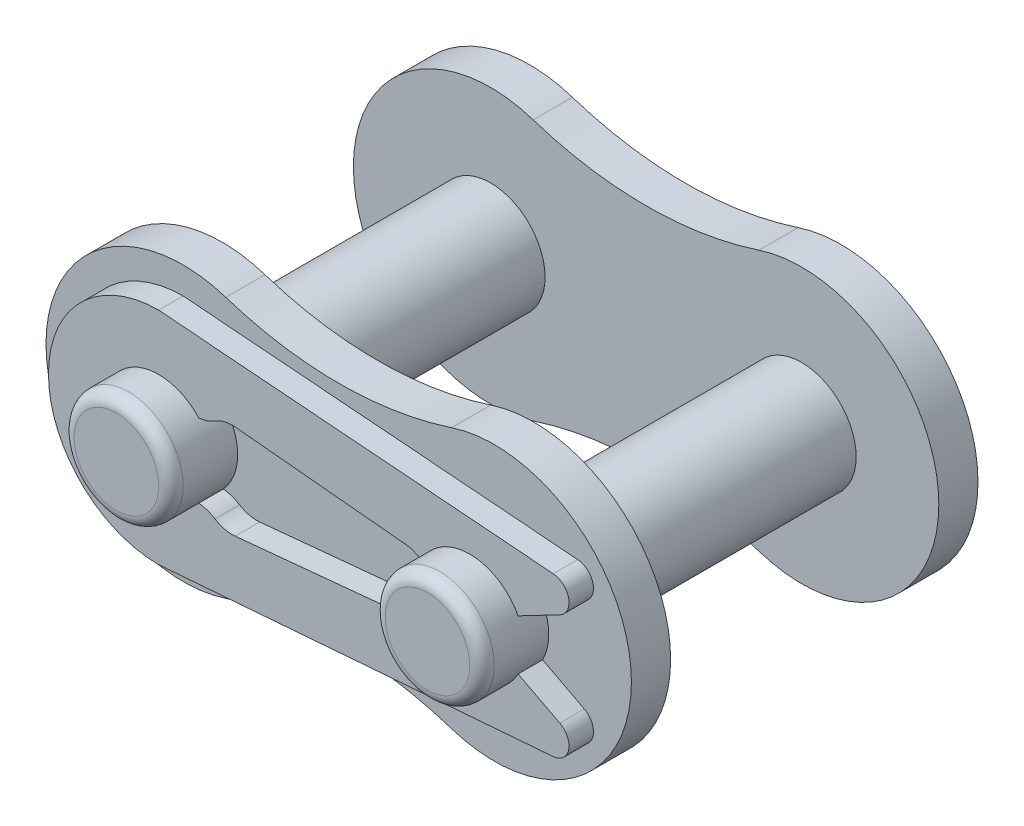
ISO-10303-21;
HEADER;
FILE_DESCRIPTION(('STEP AP214'),'2;1');
FILE_NAME('part.step','',(''),(''),'','','');
FILE_SCHEMA(('AUTOMOTIVE_DESIGN { 1 0 10303 214 1 1 1 1 }'));
ENDSEC;
DATA;
#1=APPLICATION_CONTEXT('core data for automotive mechanical design processes');
#2=APPLICATION_PROTOCOL_DEFINITION('international standard','automotive_design',2000,#1);
#3=PRODUCT_CONTEXT('',#1,'mechanical');
#4=PRODUCT('Part','Part','',(#3));
#5=PRODUCT_RELATED_PRODUCT_CATEGORY('part','',(#4));
#6=PRODUCT_DEFINITION_FORMATION('','',#4);
#7=PRODUCT_DEFINITION_CONTEXT('part definition',#1,'design');
#8=PRODUCT_DEFINITION('design','',#6,#7);
#9=PRODUCT_DEFINITION_SHAPE('','',#8);
#10=(LENGTH_UNIT() NAMED_UNIT(*) SI_UNIT(.MILLI.,.METRE.));
#11=(NAMED_UNIT(*) PLANE_ANGLE_UNIT() SI_UNIT($,.RADIAN.));
#12=(NAMED_UNIT(*) SI_UNIT($,.STERADIAN.) SOLID_ANGLE_UNIT());
#13=UNCERTAINTY_MEASURE_WITH_UNIT(LENGTH_MEASURE(1.E-05),#10,'distance_accuracy_value','');
#14=(GEOMETRIC_REPRESENTATION_CONTEXT(3) GLOBAL_UNCERTAINTY_ASSIGNED_CONTEXT((#13)) GLOBAL_UNIT_ASSIGNED_CONTEXT((#10,
#11,#12)) REPRESENTATION_CONTEXT('',''));
#15=CARTESIAN_POINT('',(0.,0.,0.));
#16=DIRECTION('',(0.,0.,1.));
#17=DIRECTION('',(1.,0.,0.));
#18=AXIS2_PLACEMENT_3D('',#15,#16,#17);
#19=CARTESIAN_POINT('',(-3.175,9.70378663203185,7.075));
#20=DIRECTION('',(0.,0.,-1.));
#21=DIRECTION('',(1.,0.,0.));
#22=AXIS2_PLACEMENT_3D('',#19,#20,#21);
#23=PLANE('',#22);
#24=CARTESIAN_POINT('',(-11.2,3.,7.075));
#25=DIRECTION('',(0.,0.,1.));
#26=DIRECTION('',(1.,0.,0.));
#27=AXIS2_PLACEMENT_3D('',#24,#25,#26);
#28=CIRCLE('',#27,1.5);
#29=CARTESIAN_POINT('',(-11.0624344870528,1.50632141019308,7.075));
#30=VERTEX_POINT('',#29);
#31=CARTESIAN_POINT('',(-10.3964285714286,1.73340102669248,7.075));
#32=VERTEX_POINT('',#31);
#33=EDGE_CURVE('E298',#30,#32,#28,.T.);
#34=ORIENTED_EDGE('',*,*,#33,.F.);
#35=CARTESIAN_POINT('',(-12.7,0.,7.075));
#36=DIRECTION('',(0.,0.,-1.));
#37=DIRECTION('',(-1.,0.,0.));
#38=AXIS2_PLACEMENT_3D('',#35,#36,#37);
#39=CIRCLE('',#38,2.225);
#40=CARTESIAN_POINT('',(-11.0624344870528,-1.50632141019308,7.075));
#41=VERTEX_POINT('',#40);
#42=EDGE_CURVE('E39',#41,#30,#39,.F.);
#43=ORIENTED_EDGE('',*,*,#42,.F.);
#44=CARTESIAN_POINT('',(-11.2,-3.,7.075));
#45=DIRECTION('',(0.,0.,1.));
#46=DIRECTION('',(1.,0.,0.));
#47=AXIS2_PLACEMENT_3D('',#44,#45,#46);
#48=CIRCLE('',#47,1.5);
#49=CARTESIAN_POINT('',(-10.3964285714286,-1.73340102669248,7.075));
#50=VERTEX_POINT('',#49);
#51=EDGE_CURVE('E237',#41,#50,#48,.F.);
#52=ORIENTED_EDGE('',*,*,#51,.T.);
#53=CARTESIAN_POINT('',(-9.7,-0.635681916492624,7.075));
#54=DIRECTION('',(0.,0.,1.));
#55=DIRECTION('',(1.,0.,0.));
#56=AXIS2_PLACEMENT_3D('',#53,#54,#55);
#57=CIRCLE('',#56,1.3);
#58=CARTESIAN_POINT('',(-9.57540052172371,-1.92969697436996,7.075));
#59=VERTEX_POINT('',#58);
#60=EDGE_CURVE('E251',#59,#50,#57,.F.);
#61=ORIENTED_EDGE('',*,*,#60,.F.);
#62=DIRECTION('',(-0.995396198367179,-0.0958457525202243,0.));
#63=VECTOR('',#62,1.);
#64=CARTESIAN_POINT('',(0.0961382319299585,-0.998433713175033,7.075));
#65=LINE('',#64,#63);
#66=CARTESIAN_POINT('',(-2.5685573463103,-1.25501471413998,7.075));
#67=VERTEX_POINT('',#66);
#68=EDGE_CURVE('E335',#67,#59,#65,.T.);
#69=ORIENTED_EDGE('',*,*,#68,.F.);
#70=CARTESIAN_POINT('',(-2.66440309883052,-0.259618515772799,7.075));
#71=DIRECTION('',(0.,0.,1.));
#72=DIRECTION('',(1.,0.,0.));
#73=AXIS2_PLACEMENT_3D('',#70,#71,#72);
#74=CIRCLE('',#73,1.);
#75=CARTESIAN_POINT('',(-2.20265448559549,-1.14662934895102,7.075));
#76=VERTEX_POINT('',#75);
#77=EDGE_CURVE('E333',#76,#67,#74,.F.);
#78=ORIENTED_EDGE('',*,*,#77,.F.);
#79=DIRECTION('',(-0.88701083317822,-0.461748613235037,0.));
#80=VECTOR('',#79,1.);
#81=CARTESIAN_POINT('',(0.,0.,7.075));
#82=LINE('',#81,#80);
#83=CARTESIAN_POINT('',(-1.97359910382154,-1.02739066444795,7.075));
#84=VERTEX_POINT('',#83);
#85=EDGE_CURVE('E331',#84,#76,#82,.T.);
#86=ORIENTED_EDGE('',*,*,#85,.F.);
#87=CARTESIAN_POINT('',(0.,0.,7.075));
#88=DIRECTION('',(0.,0.,-1.));
#89=DIRECTION('',(-1.,0.,0.));
#90=AXIS2_PLACEMENT_3D('',#87,#88,#89);
#91=CIRCLE('',#90,2.225);
#92=CARTESIAN_POINT('',(-1.97359910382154,1.02739066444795,7.075));
#93=VERTEX_POINT('',#92);
#94=EDGE_CURVE('E44',#84,#93,#91,.T.);
#95=ORIENTED_EDGE('',*,*,#94,.T.);
#96=DIRECTION('',(-0.887010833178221,0.461748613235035,0.));
#97=VECTOR('',#96,1.);
#98=CARTESIAN_POINT('',(0.,0.,7.075));
#99=LINE('',#98,#97);
#100=CARTESIAN_POINT('',(-2.20265448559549,1.14662934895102,7.075));
#101=VERTEX_POINT('',#100);
#102=EDGE_CURVE('E310',#93,#101,#99,.T.);
#103=ORIENTED_EDGE('',*,*,#102,.T.);
#104=CARTESIAN_POINT('',(-2.66440309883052,0.259618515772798,7.075));
#105=DIRECTION('',(0.,0.,1.));
#106=DIRECTION('',(1.,0.,0.));
#107=AXIS2_PLACEMENT_3D('',#104,#105,#106);
#108=CIRCLE('',#107,1.);
#109=CARTESIAN_POINT('',(-2.5685573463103,1.25501471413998,7.075));
#110=VERTEX_POINT('',#109);
#111=EDGE_CURVE('E307',#101,#110,#108,.T.);
#112=ORIENTED_EDGE('',*,*,#111,.T.);
#113=DIRECTION('',(-0.995396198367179,0.0958457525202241,0.));
#114=VECTOR('',#113,1.);
#115=CARTESIAN_POINT('',(0.0961382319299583,0.998433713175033,7.075));
#116=LINE('',#115,#114);
#117=CARTESIAN_POINT('',(-9.57540052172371,1.92969697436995,7.075));
#118=VERTEX_POINT('',#117);
#119=EDGE_CURVE('E304',#110,#118,#116,.T.);
#120=ORIENTED_EDGE('',*,*,#119,.T.);
#121=CARTESIAN_POINT('',(-9.7,0.635681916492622,7.075));
#122=DIRECTION('',(0.,0.,1.));
#123=DIRECTION('',(1.,0.,0.));
#124=AXIS2_PLACEMENT_3D('',#121,#122,#123);
#125=CIRCLE('',#124,1.3);
#126=EDGE_CURVE('E301',#118,#32,#125,.T.);
#127=ORIENTED_EDGE('',*,*,#126,.T.);
#128=EDGE_LOOP('',(#34,#43,#52,#61,#69,#78,#86,#95,#103,#112,#120,#127));
#129=FACE_BOUND('',#128,.T.);
#130=ADVANCED_FACE('F35',(#129),#23,.F.);
#131=CARTESIAN_POINT('',(-6.35,19.4075732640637,7.075));
#132=DIRECTION('',(0.,0.,-1.));
#133=DIRECTION('',(1.,0.,0.));
#134=AXIS2_PLACEMENT_3D('',#131,#132,#133);
#135=CIRCLE('',#134,14.82);
#136=CARTESIAN_POINT('',(-1.74142997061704,5.32235113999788,7.075));
#137=VERTEX_POINT('',#136);
#138=CARTESIAN_POINT('',(-10.958570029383,5.32235113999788,7.075));
#139=VERTEX_POINT('',#138);
#140=EDGE_CURVE('E408',#137,#139,#135,.T.);
#141=ORIENTED_EDGE('',*,*,#140,.T.);
#142=CARTESIAN_POINT('',(-12.7,0.,7.075));
#143=DIRECTION('',(0.,0.,1.));
#144=DIRECTION('',(1.,0.,0.));
#145=AXIS2_PLACEMENT_3D('',#142,#143,#144);
#146=CIRCLE('',#145,5.6);
#147=CARTESIAN_POINT('',(-10.958570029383,-5.32235113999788,7.075));
#148=VERTEX_POINT('',#147);
#149=EDGE_CURVE('E400',#139,#148,#146,.T.);
#150=ORIENTED_EDGE('',*,*,#149,.T.);
#151=CARTESIAN_POINT('',(-6.35,-19.4075732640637,7.075));
#152=DIRECTION('',(0.,0.,-1.));
#153=DIRECTION('',(-1.,0.,0.));
#154=AXIS2_PLACEMENT_3D('',#151,#152,#153);
#155=CIRCLE('',#154,14.82);
#156=CARTESIAN_POINT('',(-1.74142997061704,-5.32235113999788,7.075));
#157=VERTEX_POINT('',#156);
#158=EDGE_CURVE('E392',#148,#157,#155,.T.);
#159=ORIENTED_EDGE('',*,*,#158,.T.);
#160=CARTESIAN_POINT('',(0.,0.,7.075));
#161=DIRECTION('',(0.,0.,1.));
#162=DIRECTION('',(1.,0.,0.));
#163=AXIS2_PLACEMENT_3D('',#160,#161,#162);
#164=CIRCLE('',#163,5.6);
#165=EDGE_CURVE('E242',#157,#137,#164,.T.);
#166=ORIENTED_EDGE('',*,*,#165,.T.);
#167=EDGE_LOOP('',(#141,#150,#159,#166));
#168=FACE_BOUND('',#167,.T.);
#169=DIRECTION('',(0.887010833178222,0.461748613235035,0.));
#170=VECTOR('',#169,1.);
#171=CARTESIAN_POINT('',(0.,0.,7.075));
#172=LINE('',#171,#170);
#173=CARTESIAN_POINT('',(1.97359910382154,1.02739066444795,7.075));
#174=VERTEX_POINT('',#173);
#175=CARTESIAN_POINT('',(3.6759041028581,1.91355455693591,7.075));
#176=VERTEX_POINT('',#175);
#177=EDGE_CURVE('E313',#174,#176,#172,.T.);
#178=ORIENTED_EDGE('',*,*,#177,.F.);
#179=CARTESIAN_POINT('',(1.97359910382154,-1.02739066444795,7.075));
#180=VERTEX_POINT('',#179);
#181=EDGE_CURVE('E11',#174,#180,#91,.T.);
#182=ORIENTED_EDGE('',*,*,#181,.T.);
#183=DIRECTION('',(0.887010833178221,-0.461748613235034,0.));
#184=VECTOR('',#183,1.);
#185=CARTESIAN_POINT('',(0.,0.,7.075));
#186=LINE('',#185,#184);
#187=CARTESIAN_POINT('',(3.6759041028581,-1.91355455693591,7.075));
#188=VERTEX_POINT('',#187);
#189=EDGE_CURVE('E328',#180,#188,#186,.T.);
#190=ORIENTED_EDGE('',*,*,#189,.T.);
#191=CARTESIAN_POINT('',(3.35268007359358,-2.53446214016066,7.075));
#192=DIRECTION('',(0.,0.,1.));
#193=DIRECTION('',(1.,0.,0.));
#194=AXIS2_PLACEMENT_3D('',#191,#192,#193);
#195=CIRCLE('',#194,0.7);
#196=CARTESIAN_POINT('',(3.40760144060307,-3.23230427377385,7.075));
#197=VERTEX_POINT('',#196);
#198=EDGE_CURVE('E325',#197,#188,#195,.T.);
#199=ORIENTED_EDGE('',*,*,#198,.F.);
#200=DIRECTION('',(0.996917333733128,0.0784590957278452,0.));
#201=VECTOR('',#200,1.);
#202=CARTESIAN_POINT('',(0.273798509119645,-3.47893991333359,7.075));
#203=LINE('',#202,#201);
#204=CARTESIAN_POINT('',(-12.7,-4.5,7.075));
#205=VERTEX_POINT('',#204);
#206=EDGE_CURVE('E323',#205,#197,#203,.T.);
#207=ORIENTED_EDGE('',*,*,#206,.F.);
#208=CARTESIAN_POINT('',(-12.7,0.,7.075));
#209=DIRECTION('',(0.,0.,1.));
#210=DIRECTION('',(1.,0.,0.));
#211=AXIS2_PLACEMENT_3D('',#208,#209,#210);
#212=CIRCLE('',#211,4.5);
#213=CARTESIAN_POINT('',(-12.7,4.5,7.075));
#214=VERTEX_POINT('',#213);
#215=EDGE_CURVE('E321',#214,#205,#212,.T.);
#216=ORIENTED_EDGE('',*,*,#215,.F.);
#217=DIRECTION('',(0.996917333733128,-0.0784590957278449,0.));
#218=VECTOR('',#217,1.);
#219=CARTESIAN_POINT('',(0.273798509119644,3.47893991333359,7.075));
#220=LINE('',#219,#218);
#221=CARTESIAN_POINT('',(3.40760144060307,3.23230427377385,7.075));
#222=VERTEX_POINT('',#221);
#223=EDGE_CURVE('E318',#214,#222,#220,.T.);
#224=ORIENTED_EDGE('',*,*,#223,.T.);
#225=CARTESIAN_POINT('',(3.35268007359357,2.53446214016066,7.075));
#226=DIRECTION('',(0.,0.,1.));
#227=DIRECTION('',(1.,0.,0.));
#228=AXIS2_PLACEMENT_3D('',#225,#226,#227);
#229=CIRCLE('',#228,0.7);
#230=EDGE_CURVE('E315',#176,#222,#229,.T.);
#231=ORIENTED_EDGE('',*,*,#230,.F.);
#232=EDGE_LOOP('',(#178,#182,#190,#199,#207,#216,#224,#231));
#233=FACE_BOUND('',#232,.T.);
#234=ADVANCED_FACE('F498',(#168,#233),#23,.F.);
#235=CARTESIAN_POINT('',(0.,0.,-9.31));
#236=DIRECTION('',(0.,0.,-1.));
#237=DIRECTION('',(-1.,0.,0.));
#238=AXIS2_PLACEMENT_3D('',#235,#236,#237);
#239=CYLINDRICAL_SURFACE('',#238,2.225);
#240=CARTESIAN_POINT('',(0.,0.,5.475));
#241=DIRECTION('',(0.,0.,-1.));
#242=DIRECTION('',(-1.,0.,0.));
#243=AXIS2_PLACEMENT_3D('',#240,#241,#242);
#244=CIRCLE('',#243,2.225);
#245=CARTESIAN_POINT('',(-2.225,0.,5.475));
#246=VERTEX_POINT('',#245);
#247=EDGE_CURVE('E414',#246,#246,#244,.T.);
#248=ORIENTED_EDGE('',*,*,#247,.T.);
#249=EDGE_LOOP('',(#248));
#250=FACE_BOUND('',#249,.T.);
#251=CARTESIAN_POINT('',(0.,0.,-5.475));
#252=DIRECTION('',(0.,0.,1.));
#253=DIRECTION('',(1.,0.,0.));
#254=AXIS2_PLACEMENT_3D('',#251,#252,#253);
#255=CIRCLE('',#254,2.225);
#256=CARTESIAN_POINT('',(2.225,0.,-5.475));
#257=VERTEX_POINT('',#256);
#258=EDGE_CURVE('E431',#257,#257,#255,.T.);
#259=ORIENTED_EDGE('',*,*,#258,.T.);
#260=EDGE_LOOP('',(#259));
#261=FACE_BOUND('',#260,.T.);
#262=ADVANCED_FACE('F492',(#250,#261),#239,.T.);
#263=CARTESIAN_POINT('',(-3.175,9.70378663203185,-7.075));
#264=DIRECTION('',(0.,0.,1.));
#265=DIRECTION('',(1.,0.,0.));
#266=AXIS2_PLACEMENT_3D('',#263,#264,#265);
#267=PLANE('',#266);
#268=CARTESIAN_POINT('',(-12.7,0.,-7.075));
#269=DIRECTION('',(0.,0.,1.));
#270=DIRECTION('',(1.,0.,0.));
#271=AXIS2_PLACEMENT_3D('',#268,#269,#270);
#272=CIRCLE('',#271,3.2);
#273=CARTESIAN_POINT('',(-9.5,0.,-7.075));
#274=VERTEX_POINT('',#273);
#275=EDGE_CURVE('E422',#274,#274,#272,.T.);
#276=ORIENTED_EDGE('',*,*,#275,.T.);
#277=EDGE_LOOP('',(#276));
#278=FACE_BOUND('',#277,.T.);
#279=CARTESIAN_POINT('',(-6.35,19.4075732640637,-7.075));
#280=DIRECTION('',(0.,0.,-1.));
#281=DIRECTION('',(1.,0.,0.));
#282=AXIS2_PLACEMENT_3D('',#279,#280,#281);
#283=CIRCLE('',#282,14.82);
#284=CARTESIAN_POINT('',(-1.74142997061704,5.32235113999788,-7.075));
#285=VERTEX_POINT('',#284);
#286=CARTESIAN_POINT('',(-10.958570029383,5.32235113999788,-7.075));
#287=VERTEX_POINT('',#286);
#288=EDGE_CURVE('E434',#285,#287,#283,.T.);
#289=ORIENTED_EDGE('',*,*,#288,.F.);
#290=CARTESIAN_POINT('',(0.,0.,-7.075));
#291=DIRECTION('',(0.,0.,1.));
#292=DIRECTION('',(1.,0.,0.));
#293=AXIS2_PLACEMENT_3D('',#290,#291,#292);
#294=CIRCLE('',#293,5.6);
#295=CARTESIAN_POINT('',(-1.74142997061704,-5.32235113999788,-7.075));
#296=VERTEX_POINT('',#295);
#297=EDGE_CURVE('E82',#296,#285,#294,.T.);
#298=ORIENTED_EDGE('',*,*,#297,.F.);
#299=CARTESIAN_POINT('',(-6.35,-19.4075732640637,-7.075));
#300=DIRECTION('',(0.,0.,-1.));
#301=DIRECTION('',(-1.,0.,0.));
#302=AXIS2_PLACEMENT_3D('',#299,#300,#301);
#303=CIRCLE('',#302,14.82);
#304=CARTESIAN_POINT('',(-10.958570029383,-5.32235113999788,-7.075));
#305=VERTEX_POINT('',#304);
#306=EDGE_CURVE('E446',#305,#296,#303,.T.);
#307=ORIENTED_EDGE('',*,*,#306,.F.);
#308=CARTESIAN_POINT('',(-12.7,0.,-7.075));
#309=DIRECTION('',(0.,0.,1.));
#310=DIRECTION('',(1.,0.,0.));
#311=AXIS2_PLACEMENT_3D('',#308,#309,#310);
#312=CIRCLE('',#311,5.6);
#313=EDGE_CURVE('E444',#287,#305,#312,.T.);
#314=ORIENTED_EDGE('',*,*,#313,.F.);
#315=EDGE_LOOP('',(#289,#298,#307,#314));
#316=FACE_BOUND('',#315,.T.);
#317=CARTESIAN_POINT('',(0.,0.,-7.075));
#318=DIRECTION('',(0.,0.,1.));
#319=DIRECTION('',(1.,0.,0.));
#320=AXIS2_PLACEMENT_3D('',#317,#318,#319);
#321=CIRCLE('',#320,3.2);
#322=CARTESIAN_POINT('',(3.2,0.,-7.075));
#323=VERTEX_POINT('',#322);
#324=EDGE_CURVE('E457',#323,#323,#321,.T.);
#325=ORIENTED_EDGE('',*,*,#324,.T.);
#326=EDGE_LOOP('',(#325));
#327=FACE_BOUND('',#326,.T.);
#328=ADVANCED_FACE('F482',(#278,#316,#327),#267,.F.);
#329=CARTESIAN_POINT('',(-3.175,9.70378663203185,-5.475));
#330=DIRECTION('',(0.,0.,1.));
#331=DIRECTION('',(1.,0.,0.));
#332=AXIS2_PLACEMENT_3D('',#329,#330,#331);
#333=PLANE('',#332);
#334=ORIENTED_EDGE('',*,*,#258,.F.);
#335=EDGE_LOOP('',(#334));
#336=FACE_BOUND('',#335,.T.);
#337=CARTESIAN_POINT('',(-6.35,19.4075732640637,-5.475));
#338=DIRECTION('',(0.,0.,-1.));
#339=DIRECTION('',(1.,0.,0.));
#340=AXIS2_PLACEMENT_3D('',#337,#338,#339);
#341=CIRCLE('',#340,14.82);
#342=CARTESIAN_POINT('',(-1.74142997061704,5.32235113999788,-5.475));
#343=VERTEX_POINT('',#342);
#344=CARTESIAN_POINT('',(-10.958570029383,5.32235113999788,-5.475));
#345=VERTEX_POINT('',#344);
#346=EDGE_CURVE('E435',#343,#345,#341,.T.);
#347=ORIENTED_EDGE('',*,*,#346,.T.);
#348=CARTESIAN_POINT('',(-12.7,0.,-5.475));
#349=DIRECTION('',(0.,0.,1.));
#350=DIRECTION('',(1.,0.,0.));
#351=AXIS2_PLACEMENT_3D('',#348,#349,#350);
#352=CIRCLE('',#351,5.6);
#353=CARTESIAN_POINT('',(-10.958570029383,-5.32235113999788,-5.475));
#354=VERTEX_POINT('',#353);
#355=EDGE_CURVE('E90',#345,#354,#352,.T.);
#356=ORIENTED_EDGE('',*,*,#355,.T.);
#357=CARTESIAN_POINT('',(-6.35,-19.4075732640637,-5.475));
#358=DIRECTION('',(0.,0.,-1.));
#359=DIRECTION('',(-1.,0.,0.));
#360=AXIS2_PLACEMENT_3D('',#357,#358,#359);
#361=CIRCLE('',#360,14.82);
#362=CARTESIAN_POINT('',(-1.74142997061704,-5.32235113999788,-5.475));
#363=VERTEX_POINT('',#362);
#364=EDGE_CURVE('E438',#354,#363,#361,.T.);
#365=ORIENTED_EDGE('',*,*,#364,.T.);
#366=CARTESIAN_POINT('',(0.,0.,-5.475));
#367=DIRECTION('',(0.,0.,1.));
#368=DIRECTION('',(1.,0.,0.));
#369=AXIS2_PLACEMENT_3D('',#366,#367,#368);
#370=CIRCLE('',#369,5.6);
#371=EDGE_CURVE('E61',#363,#343,#370,.T.);
#372=ORIENTED_EDGE('',*,*,#371,.T.);
#373=EDGE_LOOP('',(#347,#356,#365,#372));
#374=FACE_BOUND('',#373,.T.);
#375=CARTESIAN_POINT('',(-12.7,0.,-5.475));
#376=DIRECTION('',(0.,0.,1.));
#377=DIRECTION('',(1.,0.,0.));
#378=AXIS2_PLACEMENT_3D('',#375,#376,#377);
#379=CIRCLE('',#378,2.225);
#380=CARTESIAN_POINT('',(-10.475,0.,-5.475));
#381=VERTEX_POINT('',#380);
#382=EDGE_CURVE('E428',#381,#381,#379,.T.);
#383=ORIENTED_EDGE('',*,*,#382,.F.);
#384=EDGE_LOOP('',(#383));
#385=FACE_BOUND('',#384,.T.);
#386=ADVANCED_FACE('F479',(#336,#374,#385),#333,.T.);
#387=CARTESIAN_POINT('',(-6.35,19.4075732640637,-5.475));
#388=DIRECTION('',(0.,0.,-1.));
#389=DIRECTION('',(-1.,0.,0.));
#390=AXIS2_PLACEMENT_3D('',#387,#388,#389);
#391=CYLINDRICAL_SURFACE('',#390,14.82);
#392=ORIENTED_EDGE('',*,*,#288,.T.);
#393=DIRECTION('',(0.,0.,-1.));
#394=VECTOR('',#393,1.);
#395=CARTESIAN_POINT('',(-10.958570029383,5.32235113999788,-5.475));
#396=LINE('',#395,#394);
#397=EDGE_CURVE('E455',#345,#287,#396,.T.);
#398=ORIENTED_EDGE('',*,*,#397,.F.);
#399=ORIENTED_EDGE('',*,*,#346,.F.);
#400=DIRECTION('',(0.,0.,-1.));
#401=VECTOR('',#400,1.);
#402=CARTESIAN_POINT('',(-1.74142997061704,5.32235113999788,-5.475));
#403=LINE('',#402,#401);
#404=EDGE_CURVE('E441',#343,#285,#403,.T.);
#405=ORIENTED_EDGE('',*,*,#404,.T.);
#406=EDGE_LOOP('',(#392,#398,#399,#405));
#407=FACE_BOUND('',#406,.T.);
#408=ADVANCED_FACE('F481',(#407),#391,.F.);
#409=CARTESIAN_POINT('',(-12.7,0.,-5.475));
#410=DIRECTION('',(0.,0.,-1.));
#411=DIRECTION('',(-1.,0.,0.));
#412=AXIS2_PLACEMENT_3D('',#409,#410,#411);
#413=CYLINDRICAL_SURFACE('',#412,5.6);
#414=ORIENTED_EDGE('',*,*,#313,.T.);
#415=DIRECTION('',(0.,0.,-1.));
#416=VECTOR('',#415,1.);
#417=CARTESIAN_POINT('',(-10.958570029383,-5.32235113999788,-5.475));
#418=LINE('',#417,#416);
#419=EDGE_CURVE('E452',#354,#305,#418,.T.);
#420=ORIENTED_EDGE('',*,*,#419,.F.);
#421=ORIENTED_EDGE('',*,*,#355,.F.);
#422=ORIENTED_EDGE('',*,*,#397,.T.);
#423=EDGE_LOOP('',(#414,#420,#421,#422));
#424=FACE_BOUND('',#423,.T.);
#425=ADVANCED_FACE('F489',(#424),#413,.T.);
#426=CARTESIAN_POINT('',(-6.35,-19.4075732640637,-5.475));
#427=DIRECTION('',(0.,0.,-1.));
#428=DIRECTION('',(-1.,0.,0.));
#429=AXIS2_PLACEMENT_3D('',#426,#427,#428);
#430=CYLINDRICAL_SURFACE('',#429,14.82);
#431=ORIENTED_EDGE('',*,*,#306,.T.);
#432=DIRECTION('',(0.,0.,-1.));
#433=VECTOR('',#432,1.);
#434=CARTESIAN_POINT('',(-1.74142997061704,-5.32235113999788,-5.475));
#435=LINE('',#434,#433);
#436=EDGE_CURVE('E450',#363,#296,#435,.T.);
#437=ORIENTED_EDGE('',*,*,#436,.F.);
#438=ORIENTED_EDGE('',*,*,#364,.F.);
#439=ORIENTED_EDGE('',*,*,#419,.T.);
#440=EDGE_LOOP('',(#431,#437,#438,#439));
#441=FACE_BOUND('',#440,.T.);
#442=ADVANCED_FACE('F693',(#441),#430,.F.);
#443=CARTESIAN_POINT('',(0.,0.,-5.475));
#444=DIRECTION('',(0.,0.,-1.));
#445=DIRECTION('',(-1.,0.,0.));
#446=AXIS2_PLACEMENT_3D('',#443,#444,#445);
#447=CYLINDRICAL_SURFACE('',#446,5.6);
#448=ORIENTED_EDGE('',*,*,#297,.T.);
#449=ORIENTED_EDGE('',*,*,#404,.F.);
#450=ORIENTED_EDGE('',*,*,#371,.F.);
#451=ORIENTED_EDGE('',*,*,#436,.T.);
#452=EDGE_LOOP('',(#448,#449,#450,#451));
#453=FACE_BOUND('',#452,.T.);
#454=ADVANCED_FACE('F540',(#453),#447,.T.);
#455=CARTESIAN_POINT('',(0.,0.,-3.87334905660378));
#456=DIRECTION('',(0.,0.,-1.));
#457=DIRECTION('',(1.,0.,0.));
#458=AXIS2_PLACEMENT_3D('',#455,#456,#457);
#459=SPHERICAL_SURFACE('',#458,4.52665094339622);
#460=ORIENTED_EDGE('',*,*,#324,.F.);
#461=EDGE_LOOP('',(#460));
#462=FACE_BOUND('',#461,.T.);
#463=ADVANCED_FACE('F475',(#462),#459,.T.);
#464=CARTESIAN_POINT('',(-12.7,0.,9.8));
#465=DIRECTION('',(0.,0.,1.));
#466=DIRECTION('',(1.,0.,0.));
#467=AXIS2_PLACEMENT_3D('',#464,#465,#466);
#468=CYLINDRICAL_SURFACE('',#467,2.225);
#469=CARTESIAN_POINT('',(-12.7,0.,5.475));
#470=DIRECTION('',(0.,0.,-1.));
#471=DIRECTION('',(-1.,0.,0.));
#472=AXIS2_PLACEMENT_3D('',#469,#470,#471);
#473=CIRCLE('',#472,2.225);
#474=CARTESIAN_POINT('',(-14.925,0.,5.475));
#475=VERTEX_POINT('',#474);
#476=EDGE_CURVE('E418',#475,#475,#473,.F.);
#477=ORIENTED_EDGE('',*,*,#476,.F.);
#478=EDGE_LOOP('',(#477));
#479=FACE_BOUND('',#478,.T.);
#480=ORIENTED_EDGE('',*,*,#382,.T.);
#481=EDGE_LOOP('',(#480));
#482=FACE_BOUND('',#481,.T.);
#483=ADVANCED_FACE('F471',(#479,#482),#468,.T.);
#484=CARTESIAN_POINT('',(-12.7,0.,-3.87334905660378));
#485=DIRECTION('',(0.,0.,1.));
#486=DIRECTION('',(-1.,0.,0.));
#487=AXIS2_PLACEMENT_3D('',#484,#485,#486);
#488=SPHERICAL_SURFACE('',#487,4.52665094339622);
#489=ORIENTED_EDGE('',*,*,#275,.F.);
#490=EDGE_LOOP('',(#489));
#491=FACE_BOUND('',#490,.T.);
#492=ADVANCED_FACE('F474',(#491),#488,.T.);
#493=CARTESIAN_POINT('',(-3.175,9.70378663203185,5.475));
#494=DIRECTION('',(0.,0.,-1.));
#495=DIRECTION('',(1.,0.,0.));
#496=AXIS2_PLACEMENT_3D('',#493,#494,#495);
#497=PLANE('',#496);
#498=ORIENTED_EDGE('',*,*,#476,.T.);
#499=EDGE_LOOP('',(#498));
#500=FACE_BOUND('',#499,.T.);
#501=CARTESIAN_POINT('',(-6.35,19.4075732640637,5.475));
#502=DIRECTION('',(0.,0.,-1.));
#503=DIRECTION('',(1.,0.,0.));
#504=AXIS2_PLACEMENT_3D('',#501,#502,#503);
#505=CIRCLE('',#504,14.82);
#506=CARTESIAN_POINT('',(-1.74142997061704,5.32235113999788,5.475));
#507=VERTEX_POINT('',#506);
#508=CARTESIAN_POINT('',(-10.958570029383,5.32235113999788,5.475));
#509=VERTEX_POINT('',#508);
#510=EDGE_CURVE('E411',#507,#509,#505,.T.);
#511=ORIENTED_EDGE('',*,*,#510,.F.);
#512=CARTESIAN_POINT('',(0.,0.,5.475));
#513=DIRECTION('',(0.,0.,1.));
#514=DIRECTION('',(1.,0.,0.));
#515=AXIS2_PLACEMENT_3D('',#512,#513,#514);
#516=CIRCLE('',#515,5.6);
#517=CARTESIAN_POINT('',(-1.74142997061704,-5.32235113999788,5.475));
#518=VERTEX_POINT('',#517);
#519=EDGE_CURVE('E387',#518,#507,#516,.T.);
#520=ORIENTED_EDGE('',*,*,#519,.F.);
#521=CARTESIAN_POINT('',(-6.35,-19.4075732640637,5.475));
#522=DIRECTION('',(0.,0.,-1.));
#523=DIRECTION('',(-1.,0.,0.));
#524=AXIS2_PLACEMENT_3D('',#521,#522,#523);
#525=CIRCLE('',#524,14.82);
#526=CARTESIAN_POINT('',(-10.958570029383,-5.32235113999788,5.475));
#527=VERTEX_POINT('',#526);
#528=EDGE_CURVE('E395',#527,#518,#525,.T.);
#529=ORIENTED_EDGE('',*,*,#528,.F.);
#530=CARTESIAN_POINT('',(-12.7,0.,5.475));
#531=DIRECTION('',(0.,0.,1.));
#532=DIRECTION('',(1.,0.,0.));
#533=AXIS2_PLACEMENT_3D('',#530,#531,#532);
#534=CIRCLE('',#533,5.6);
#535=EDGE_CURVE('E403',#509,#527,#534,.T.);
#536=ORIENTED_EDGE('',*,*,#535,.F.);
#537=EDGE_LOOP('',(#511,#520,#529,#536));
#538=FACE_BOUND('',#537,.T.);
#539=ORIENTED_EDGE('',*,*,#247,.F.);
#540=EDGE_LOOP('',(#539));
#541=FACE_BOUND('',#540,.T.);
#542=ADVANCED_FACE('F468',(#500,#538,#541),#497,.T.);
#543=CARTESIAN_POINT('',(-6.35,19.4075732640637,5.475));
#544=DIRECTION('',(0.,0.,1.));
#545=DIRECTION('',(-1.,0.,0.));
#546=AXIS2_PLACEMENT_3D('',#543,#544,#545);
#547=CYLINDRICAL_SURFACE('',#546,14.82);
#548=ORIENTED_EDGE('',*,*,#140,.F.);
#549=DIRECTION('',(0.,0.,1.));
#550=VECTOR('',#549,1.);
#551=CARTESIAN_POINT('',(-1.74142997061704,5.32235113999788,5.475));
#552=LINE('',#551,#550);
#553=EDGE_CURVE('E385',#507,#137,#552,.T.);
#554=ORIENTED_EDGE('',*,*,#553,.F.);
#555=ORIENTED_EDGE('',*,*,#510,.T.);
#556=DIRECTION('',(0.,0.,1.));
#557=VECTOR('',#556,1.);
#558=CARTESIAN_POINT('',(-10.958570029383,5.32235113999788,5.475));
#559=LINE('',#558,#557);
#560=EDGE_CURVE('E406',#509,#139,#559,.T.);
#561=ORIENTED_EDGE('',*,*,#560,.T.);
#562=EDGE_LOOP('',(#548,#554,#555,#561));
#563=FACE_BOUND('',#562,.T.);
#564=ADVANCED_FACE('F654',(#563),#547,.F.);
#565=CARTESIAN_POINT('',(-12.7,0.,5.475));
#566=DIRECTION('',(0.,0.,1.));
#567=DIRECTION('',(-1.,0.,0.));
#568=AXIS2_PLACEMENT_3D('',#565,#566,#567);
#569=CYLINDRICAL_SURFACE('',#568,5.6);
#570=ORIENTED_EDGE('',*,*,#149,.F.);
#571=ORIENTED_EDGE('',*,*,#560,.F.);
#572=ORIENTED_EDGE('',*,*,#535,.T.);
#573=DIRECTION('',(0.,0.,1.));
#574=VECTOR('',#573,1.);
#575=CARTESIAN_POINT('',(-10.958570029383,-5.32235113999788,5.475));
#576=LINE('',#575,#574);
#577=EDGE_CURVE('E398',#527,#148,#576,.T.);
#578=ORIENTED_EDGE('',*,*,#577,.T.);
#579=EDGE_LOOP('',(#570,#571,#572,#578));
#580=FACE_BOUND('',#579,.T.);
#581=ADVANCED_FACE('F651',(#580),#569,.T.);
#582=CARTESIAN_POINT('',(-6.35,-19.4075732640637,5.475));
#583=DIRECTION('',(0.,0.,1.));
#584=DIRECTION('',(-1.,0.,0.));
#585=AXIS2_PLACEMENT_3D('',#582,#583,#584);
#586=CYLINDRICAL_SURFACE('',#585,14.82);
#587=ORIENTED_EDGE('',*,*,#158,.F.);
#588=ORIENTED_EDGE('',*,*,#577,.F.);
#589=ORIENTED_EDGE('',*,*,#528,.T.);
#590=DIRECTION('',(0.,0.,1.));
#591=VECTOR('',#590,1.);
#592=CARTESIAN_POINT('',(-1.74142997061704,-5.32235113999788,5.475));
#593=LINE('',#592,#591);
#594=EDGE_CURVE('E390',#518,#157,#593,.T.);
#595=ORIENTED_EDGE('',*,*,#594,.T.);
#596=EDGE_LOOP('',(#587,#588,#589,#595));
#597=FACE_BOUND('',#596,.T.);
#598=ADVANCED_FACE('F647',(#597),#586,.F.);
#599=CARTESIAN_POINT('',(0.,0.,5.475));
#600=DIRECTION('',(0.,0.,1.));
#601=DIRECTION('',(-1.,0.,0.));
#602=AXIS2_PLACEMENT_3D('',#599,#600,#601);
#603=CYLINDRICAL_SURFACE('',#602,5.6);
#604=ORIENTED_EDGE('',*,*,#165,.F.);
#605=ORIENTED_EDGE('',*,*,#594,.F.);
#606=ORIENTED_EDGE('',*,*,#519,.T.);
#607=ORIENTED_EDGE('',*,*,#553,.T.);
#608=EDGE_LOOP('',(#604,#605,#606,#607));
#609=FACE_BOUND('',#608,.T.);
#610=ADVANCED_FACE('F515',(#609),#603,.T.);
#611=CARTESIAN_POINT('',(-12.7,0.,9.8));
#612=DIRECTION('',(0.,0.,1.));
#613=DIRECTION('',(1.,0.,0.));
#614=AXIS2_PLACEMENT_3D('',#611,#612,#613);
#615=PLANE('',#614);
#616=CARTESIAN_POINT('',(-12.7,0.,9.8));
#617=DIRECTION('',(0.,0.,1.));
#618=DIRECTION('',(1.,0.,0.));
#619=AXIS2_PLACEMENT_3D('',#616,#617,#618);
#620=CIRCLE('',#619,1.725);
#621=CARTESIAN_POINT('',(-10.975,0.,9.8));
#622=VERTEX_POINT('',#621);
#623=EDGE_CURVE('E425',#622,#622,#620,.T.);
#624=ORIENTED_EDGE('',*,*,#623,.T.);
#625=EDGE_LOOP('',(#624));
#626=FACE_BOUND('',#625,.T.);
#627=ADVANCED_FACE('F512',(#626),#615,.T.);
#628=CARTESIAN_POINT('',(-12.7,0.,9.3));
#629=DIRECTION('',(0.,0.,1.));
#630=DIRECTION('',(1.,0.,0.));
#631=AXIS2_PLACEMENT_3D('',#628,#629,#630);
#632=TOROIDAL_SURFACE('',#631,1.725,0.5);
#633=CARTESIAN_POINT('',(-12.7,0.,9.3));
#634=DIRECTION('',(0.,0.,1.));
#635=DIRECTION('',(1.,0.,0.));
#636=AXIS2_PLACEMENT_3D('',#633,#634,#635);
#637=CIRCLE('',#636,2.225);
#638=CARTESIAN_POINT('',(-10.475,0.,9.3));
#639=VERTEX_POINT('',#638);
#640=EDGE_CURVE('E419',#639,#639,#637,.T.);
#641=ORIENTED_EDGE('',*,*,#640,.T.);
#642=EDGE_LOOP('',(#641));
#643=FACE_BOUND('',#642,.T.);
#644=ORIENTED_EDGE('',*,*,#623,.F.);
#645=EDGE_LOOP('',(#644));
#646=FACE_BOUND('',#645,.T.);
#647=ADVANCED_FACE('F514',(#643,#646),#632,.T.);
#648=DIRECTION('',(0.,0.,-1.));
#649=VECTOR('',#648,1.);
#650=CARTESIAN_POINT('',(-11.0624344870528,-1.50632141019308,8.075));
#651=LINE('',#650,#649);
#652=CARTESIAN_POINT('',(-11.0624344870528,-1.50632141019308,8.075));
#653=VERTEX_POINT('',#652);
#654=EDGE_CURVE('E232',#653,#41,#651,.T.);
#655=ORIENTED_EDGE('',*,*,#654,.T.);
#656=ORIENTED_EDGE('',*,*,#42,.T.);
#657=DIRECTION('',(0.,0.,-1.));
#658=VECTOR('',#657,1.);
#659=CARTESIAN_POINT('',(-11.0624344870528,1.50632141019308,8.075));
#660=LINE('',#659,#658);
#661=CARTESIAN_POINT('',(-11.0624344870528,1.50632141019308,8.075));
#662=VERTEX_POINT('',#661);
#663=EDGE_CURVE('E243',#662,#30,#660,.T.);
#664=ORIENTED_EDGE('',*,*,#663,.F.);
#665=CARTESIAN_POINT('',(-12.7,0.,8.075));
#666=DIRECTION('',(0.,0.,1.));
#667=DIRECTION('',(1.,0.,0.));
#668=AXIS2_PLACEMENT_3D('',#665,#666,#667);
#669=CIRCLE('',#668,2.225);
#670=EDGE_CURVE('E246',#653,#662,#669,.F.);
#671=ORIENTED_EDGE('',*,*,#670,.F.);
#672=EDGE_LOOP('',(#655,#656,#664,#671));
#673=FACE_BOUND('',#672,.T.);
#674=ORIENTED_EDGE('',*,*,#640,.F.);
#675=EDGE_LOOP('',(#674));
#676=FACE_BOUND('',#675,.T.);
#677=ADVANCED_FACE('F254',(#673,#676),#468,.T.);
#678=CARTESIAN_POINT('',(1.725,0.,9.8));
#679=DIRECTION('',(0.,0.,-1.));
#680=DIRECTION('',(-1.,0.,0.));
#681=AXIS2_PLACEMENT_3D('',#678,#679,#680);
#682=PLANE('',#681);
#683=CARTESIAN_POINT('',(0.,0.,9.8));
#684=DIRECTION('',(0.,0.,-1.));
#685=DIRECTION('',(-1.,0.,0.));
#686=AXIS2_PLACEMENT_3D('',#683,#684,#685);
#687=CIRCLE('',#686,1.725);
#688=CARTESIAN_POINT('',(-1.725,0.,9.8));
#689=VERTEX_POINT('',#688);
#690=EDGE_CURVE('E460',#689,#689,#687,.T.);
#691=ORIENTED_EDGE('',*,*,#690,.F.);
#692=EDGE_LOOP('',(#691));
#693=FACE_BOUND('',#692,.T.);
#694=ADVANCED_FACE('F522',(#693),#682,.F.);
#695=CARTESIAN_POINT('',(0.,0.,9.3));
#696=DIRECTION('',(0.,0.,-1.));
#697=DIRECTION('',(-1.,0.,0.));
#698=AXIS2_PLACEMENT_3D('',#695,#696,#697);
#699=TOROIDAL_SURFACE('',#698,1.725,0.5);
#700=CARTESIAN_POINT('',(0.,0.,9.3));
#701=DIRECTION('',(0.,0.,-1.));
#702=DIRECTION('',(-1.,0.,0.));
#703=AXIS2_PLACEMENT_3D('',#700,#701,#702);
#704=CIRCLE('',#703,2.225);
#705=CARTESIAN_POINT('',(-2.225,0.,9.3));
#706=VERTEX_POINT('',#705);
#707=EDGE_CURVE('E463',#706,#706,#704,.T.);
#708=ORIENTED_EDGE('',*,*,#707,.F.);
#709=EDGE_LOOP('',(#708));
#710=FACE_BOUND('',#709,.T.);
#711=ORIENTED_EDGE('',*,*,#690,.T.);
#712=EDGE_LOOP('',(#711));
#713=FACE_BOUND('',#712,.T.);
#714=ADVANCED_FACE('F37',(#710,#713),#699,.T.);
#715=CARTESIAN_POINT('',(0.,0.,8.075));
#716=DIRECTION('',(0.,0.,1.));
#717=DIRECTION('',(1.,0.,0.));
#718=AXIS2_PLACEMENT_3D('',#715,#716,#717);
#719=CIRCLE('',#718,2.225);
#720=CARTESIAN_POINT('',(-1.97359910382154,1.02739066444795,8.075));
#721=VERTEX_POINT('',#720);
#722=CARTESIAN_POINT('',(1.97359910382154,1.02739066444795,8.075));
#723=VERTEX_POINT('',#722);
#724=EDGE_CURVE('E272',#721,#723,#719,.F.);
#725=ORIENTED_EDGE('',*,*,#724,.F.);
#726=DIRECTION('',(0.,0.,-1.));
#727=VECTOR('',#726,1.);
#728=CARTESIAN_POINT('',(-1.97359910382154,1.02739066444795,8.075));
#729=LINE('',#728,#727);
#730=EDGE_CURVE('E371',#721,#93,#729,.T.);
#731=ORIENTED_EDGE('',*,*,#730,.T.);
#732=ORIENTED_EDGE('',*,*,#94,.F.);
#733=DIRECTION('',(0.,0.,-1.));
#734=VECTOR('',#733,1.);
#735=CARTESIAN_POINT('',(-1.97359910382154,-1.02739066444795,8.075));
#736=LINE('',#735,#734);
#737=CARTESIAN_POINT('',(-1.97359910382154,-1.02739066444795,8.075));
#738=VERTEX_POINT('',#737);
#739=EDGE_CURVE('E349',#738,#84,#736,.T.);
#740=ORIENTED_EDGE('',*,*,#739,.F.);
#741=CARTESIAN_POINT('',(1.97359910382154,-1.02739066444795,8.075));
#742=VERTEX_POINT('',#741);
#743=EDGE_CURVE('E275',#742,#738,#719,.F.);
#744=ORIENTED_EDGE('',*,*,#743,.F.);
#745=DIRECTION('',(0.,0.,-1.));
#746=VECTOR('',#745,1.);
#747=CARTESIAN_POINT('',(1.97359910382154,-1.02739066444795,8.075));
#748=LINE('',#747,#746);
#749=EDGE_CURVE('E351',#742,#180,#748,.T.);
#750=ORIENTED_EDGE('',*,*,#749,.T.);
#751=ORIENTED_EDGE('',*,*,#181,.F.);
#752=DIRECTION('',(0.,0.,-1.));
#753=VECTOR('',#752,1.);
#754=CARTESIAN_POINT('',(1.97359910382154,1.02739066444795,8.075));
#755=LINE('',#754,#753);
#756=EDGE_CURVE('E369',#723,#174,#755,.T.);
#757=ORIENTED_EDGE('',*,*,#756,.F.);
#758=EDGE_LOOP('',(#725,#731,#732,#740,#744,#750,#751,#757));
#759=FACE_BOUND('',#758,.T.);
#760=ORIENTED_EDGE('',*,*,#707,.T.);
#761=EDGE_LOOP('',(#760));
#762=FACE_BOUND('',#761,.T.);
#763=ADVANCED_FACE('F534',(#759,#762),#239,.T.);
#764=CARTESIAN_POINT('',(-11.2,-3.,8.075));
#765=DIRECTION('',(0.,0.,-1.));
#766=DIRECTION('',(-1.,0.,0.));
#767=AXIS2_PLACEMENT_3D('',#764,#765,#766);
#768=CYLINDRICAL_SURFACE('',#767,1.5);
#769=ORIENTED_EDGE('',*,*,#51,.F.);
#770=ORIENTED_EDGE('',*,*,#654,.F.);
#771=CARTESIAN_POINT('',(-11.2,-3.,8.075));
#772=DIRECTION('',(0.,0.,1.));
#773=DIRECTION('',(1.,0.,0.));
#774=AXIS2_PLACEMENT_3D('',#771,#772,#773);
#775=CIRCLE('',#774,1.5);
#776=CARTESIAN_POINT('',(-10.3964285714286,-1.73340102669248,8.075));
#777=VERTEX_POINT('',#776);
#778=EDGE_CURVE('E235',#653,#777,#775,.F.);
#779=ORIENTED_EDGE('',*,*,#778,.T.);
#780=DIRECTION('',(0.,0.,-1.));
#781=VECTOR('',#780,1.);
#782=CARTESIAN_POINT('',(-10.3964285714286,-1.73340102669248,8.075));
#783=LINE('',#782,#781);
#784=EDGE_CURVE('E296',#777,#50,#783,.T.);
#785=ORIENTED_EDGE('',*,*,#784,.T.);
#786=EDGE_LOOP('',(#769,#770,#779,#785));
#787=FACE_BOUND('',#786,.T.);
#788=ADVANCED_FACE('F234',(#787),#768,.T.);
#789=CARTESIAN_POINT('',(-11.2,3.,8.075));
#790=DIRECTION('',(0.,0.,-1.));
#791=DIRECTION('',(-1.,0.,0.));
#792=AXIS2_PLACEMENT_3D('',#789,#790,#791);
#793=CYLINDRICAL_SURFACE('',#792,1.5);
#794=ORIENTED_EDGE('',*,*,#33,.T.);
#795=DIRECTION('',(0.,0.,-1.));
#796=VECTOR('',#795,1.);
#797=CARTESIAN_POINT('',(-10.3964285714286,1.73340102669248,8.075));
#798=LINE('',#797,#796);
#799=CARTESIAN_POINT('',(-10.3964285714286,1.73340102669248,8.075));
#800=VERTEX_POINT('',#799);
#801=EDGE_CURVE('E380',#800,#32,#798,.T.);
#802=ORIENTED_EDGE('',*,*,#801,.F.);
#803=CARTESIAN_POINT('',(-11.2,3.,8.075));
#804=DIRECTION('',(0.,0.,1.));
#805=DIRECTION('',(1.,0.,0.));
#806=AXIS2_PLACEMENT_3D('',#803,#804,#805);
#807=CIRCLE('',#806,1.5);
#808=EDGE_CURVE('E256',#662,#800,#807,.T.);
#809=ORIENTED_EDGE('',*,*,#808,.F.);
#810=ORIENTED_EDGE('',*,*,#663,.T.);
#811=EDGE_LOOP('',(#794,#802,#809,#810));
#812=FACE_BOUND('',#811,.T.);
#813=ADVANCED_FACE('F552',(#812),#793,.T.);
#814=CARTESIAN_POINT('',(-9.7,0.635681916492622,8.075));
#815=DIRECTION('',(0.,0.,-1.));
#816=DIRECTION('',(-1.,0.,0.));
#817=AXIS2_PLACEMENT_3D('',#814,#815,#816);
#818=CYLINDRICAL_SURFACE('',#817,1.3);
#819=ORIENTED_EDGE('',*,*,#126,.F.);
#820=DIRECTION('',(0.,0.,-1.));
#821=VECTOR('',#820,1.);
#822=CARTESIAN_POINT('',(-9.57540052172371,1.92969697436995,8.075));
#823=LINE('',#822,#821);
#824=CARTESIAN_POINT('',(-9.57540052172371,1.92969697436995,8.075));
#825=VERTEX_POINT('',#824);
#826=EDGE_CURVE('E378',#825,#118,#823,.T.);
#827=ORIENTED_EDGE('',*,*,#826,.F.);
#828=CARTESIAN_POINT('',(-9.7,0.635681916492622,8.075));
#829=DIRECTION('',(0.,0.,1.));
#830=DIRECTION('',(1.,0.,0.));
#831=AXIS2_PLACEMENT_3D('',#828,#829,#830);
#832=CIRCLE('',#831,1.3);
#833=EDGE_CURVE('E258',#825,#800,#832,.T.);
#834=ORIENTED_EDGE('',*,*,#833,.T.);
#835=ORIENTED_EDGE('',*,*,#801,.T.);
#836=EDGE_LOOP('',(#819,#827,#834,#835));
#837=FACE_BOUND('',#836,.T.);
#838=ADVANCED_FACE('F640',(#837),#818,.F.);
#839=CARTESIAN_POINT('',(0.0961382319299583,0.998433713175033,8.075));
#840=DIRECTION('',(-0.0958457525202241,-0.995396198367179,0.));
#841=DIRECTION('',(0.995396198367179,-0.0958457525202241,0.));
#842=AXIS2_PLACEMENT_3D('',#839,#840,#841);
#843=PLANE('',#842);
#844=ORIENTED_EDGE('',*,*,#119,.F.);
#845=DIRECTION('',(0.,0.,-1.));
#846=VECTOR('',#845,1.);
#847=CARTESIAN_POINT('',(-2.5685573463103,1.25501471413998,8.075));
#848=LINE('',#847,#846);
#849=CARTESIAN_POINT('',(-2.5685573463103,1.25501471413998,8.075));
#850=VERTEX_POINT('',#849);
#851=EDGE_CURVE('E376',#850,#110,#848,.T.);
#852=ORIENTED_EDGE('',*,*,#851,.F.);
#853=DIRECTION('',(-0.995396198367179,0.0958457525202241,0.));
#854=VECTOR('',#853,1.);
#855=CARTESIAN_POINT('',(0.0961382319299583,0.998433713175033,8.075));
#856=LINE('',#855,#854);
#857=EDGE_CURVE('E263',#850,#825,#856,.T.);
#858=ORIENTED_EDGE('',*,*,#857,.T.);
#859=ORIENTED_EDGE('',*,*,#826,.T.);
#860=EDGE_LOOP('',(#844,#852,#858,#859));
#861=FACE_BOUND('',#860,.T.);
#862=ADVANCED_FACE('F622',(#861),#843,.T.);
#863=CARTESIAN_POINT('',(-2.66440309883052,0.259618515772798,8.075));
#864=DIRECTION('',(0.,0.,-1.));
#865=DIRECTION('',(-1.,0.,0.));
#866=AXIS2_PLACEMENT_3D('',#863,#864,#865);
#867=CYLINDRICAL_SURFACE('',#866,1.);
#868=ORIENTED_EDGE('',*,*,#111,.F.);
#869=DIRECTION('',(0.,0.,-1.));
#870=VECTOR('',#869,1.);
#871=CARTESIAN_POINT('',(-2.20265448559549,1.14662934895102,8.075));
#872=LINE('',#871,#870);
#873=CARTESIAN_POINT('',(-2.20265448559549,1.14662934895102,8.075));
#874=VERTEX_POINT('',#873);
#875=EDGE_CURVE('E374',#874,#101,#872,.T.);
#876=ORIENTED_EDGE('',*,*,#875,.F.);
#877=CARTESIAN_POINT('',(-2.66440309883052,0.259618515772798,8.075));
#878=DIRECTION('',(0.,0.,1.));
#879=DIRECTION('',(1.,0.,0.));
#880=AXIS2_PLACEMENT_3D('',#877,#878,#879);
#881=CIRCLE('',#880,1.);
#882=EDGE_CURVE('E266',#874,#850,#881,.T.);
#883=ORIENTED_EDGE('',*,*,#882,.T.);
#884=ORIENTED_EDGE('',*,*,#851,.T.);
#885=EDGE_LOOP('',(#868,#876,#883,#884));
#886=FACE_BOUND('',#885,.T.);
#887=ADVANCED_FACE('F625',(#886),#867,.F.);
#888=CARTESIAN_POINT('',(0.,0.,8.075));
#889=DIRECTION('',(-0.461748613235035,-0.887010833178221,0.));
#890=DIRECTION('',(0.887010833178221,-0.461748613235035,0.));
#891=AXIS2_PLACEMENT_3D('',#888,#889,#890);
#892=PLANE('',#891);
#893=ORIENTED_EDGE('',*,*,#102,.F.);
#894=ORIENTED_EDGE('',*,*,#730,.F.);
#895=DIRECTION('',(-0.887010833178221,0.461748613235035,0.));
#896=VECTOR('',#895,1.);
#897=CARTESIAN_POINT('',(0.,0.,8.075));
#898=LINE('',#897,#896);
#899=EDGE_CURVE('E269',#721,#874,#898,.T.);
#900=ORIENTED_EDGE('',*,*,#899,.T.);
#901=ORIENTED_EDGE('',*,*,#875,.T.);
#902=EDGE_LOOP('',(#893,#894,#900,#901));
#903=FACE_BOUND('',#902,.T.);
#904=ADVANCED_FACE('F627',(#903),#892,.T.);
#905=CARTESIAN_POINT('',(0.,0.,8.075));
#906=DIRECTION('',(-0.461748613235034,0.887010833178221,0.));
#907=DIRECTION('',(-0.887010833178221,-0.461748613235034,0.));
#908=AXIS2_PLACEMENT_3D('',#905,#906,#907);
#909=PLANE('',#908);
#910=ORIENTED_EDGE('',*,*,#177,.T.);
#911=DIRECTION('',(0.,0.,-1.));
#912=VECTOR('',#911,1.);
#913=CARTESIAN_POINT('',(3.6759041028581,1.91355455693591,8.075));
#914=LINE('',#913,#912);
#915=CARTESIAN_POINT('',(3.6759041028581,1.91355455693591,8.075));
#916=VERTEX_POINT('',#915);
#917=EDGE_CURVE('E366',#916,#176,#914,.T.);
#918=ORIENTED_EDGE('',*,*,#917,.F.);
#919=DIRECTION('',(0.887010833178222,0.461748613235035,0.));
#920=VECTOR('',#919,1.);
#921=CARTESIAN_POINT('',(0.,0.,8.075));
#922=LINE('',#921,#920);
#923=EDGE_CURVE('E274',#723,#916,#922,.T.);
#924=ORIENTED_EDGE('',*,*,#923,.F.);
#925=ORIENTED_EDGE('',*,*,#756,.T.);
#926=EDGE_LOOP('',(#910,#918,#924,#925));
#927=FACE_BOUND('',#926,.T.);
#928=ADVANCED_FACE('F566',(#927),#909,.F.);
#929=CARTESIAN_POINT('',(3.35268007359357,2.53446214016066,8.075));
#930=DIRECTION('',(0.,0.,-1.));
#931=DIRECTION('',(-1.,0.,0.));
#932=AXIS2_PLACEMENT_3D('',#929,#930,#931);
#933=CYLINDRICAL_SURFACE('',#932,0.7);
#934=ORIENTED_EDGE('',*,*,#230,.T.);
#935=DIRECTION('',(0.,0.,-1.));
#936=VECTOR('',#935,1.);
#937=CARTESIAN_POINT('',(3.40760144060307,3.23230427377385,8.075));
#938=LINE('',#937,#936);
#939=CARTESIAN_POINT('',(3.40760144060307,3.23230427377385,8.075));
#940=VERTEX_POINT('',#939);
#941=EDGE_CURVE('E364',#940,#222,#938,.T.);
#942=ORIENTED_EDGE('',*,*,#941,.F.);
#943=CARTESIAN_POINT('',(3.35268007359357,2.53446214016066,8.075));
#944=DIRECTION('',(0.,0.,1.));
#945=DIRECTION('',(1.,0.,0.));
#946=AXIS2_PLACEMENT_3D('',#943,#944,#945);
#947=CIRCLE('',#946,0.7);
#948=EDGE_CURVE('E277',#916,#940,#947,.T.);
#949=ORIENTED_EDGE('',*,*,#948,.F.);
#950=ORIENTED_EDGE('',*,*,#917,.T.);
#951=EDGE_LOOP('',(#934,#942,#949,#950));
#952=FACE_BOUND('',#951,.T.);
#953=ADVANCED_FACE('F572',(#952),#933,.T.);
#954=CARTESIAN_POINT('',(0.273798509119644,3.47893991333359,8.075));
#955=DIRECTION('',(0.0784590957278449,0.996917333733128,0.));
#956=DIRECTION('',(-0.996917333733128,0.0784590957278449,0.));
#957=AXIS2_PLACEMENT_3D('',#954,#955,#956);
#958=PLANE('',#957);
#959=ORIENTED_EDGE('',*,*,#223,.F.);
#960=DIRECTION('',(0.,0.,-1.));
#961=VECTOR('',#960,1.);
#962=CARTESIAN_POINT('',(-12.7,4.5,8.075));
#963=LINE('',#962,#961);
#964=CARTESIAN_POINT('',(-12.7,4.5,8.075));
#965=VERTEX_POINT('',#964);
#966=EDGE_CURVE('E362',#965,#214,#963,.T.);
#967=ORIENTED_EDGE('',*,*,#966,.F.);
#968=DIRECTION('',(0.996917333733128,-0.0784590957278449,0.));
#969=VECTOR('',#968,1.);
#970=CARTESIAN_POINT('',(0.273798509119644,3.47893991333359,8.075));
#971=LINE('',#970,#969);
#972=EDGE_CURVE('E279',#965,#940,#971,.T.);
#973=ORIENTED_EDGE('',*,*,#972,.T.);
#974=ORIENTED_EDGE('',*,*,#941,.T.);
#975=EDGE_LOOP('',(#959,#967,#973,#974));
#976=FACE_BOUND('',#975,.T.);
#977=ADVANCED_FACE('F578',(#976),#958,.T.);
#978=CARTESIAN_POINT('',(-12.7,0.,8.075));
#979=DIRECTION('',(0.,0.,-1.));
#980=DIRECTION('',(-1.,0.,0.));
#981=AXIS2_PLACEMENT_3D('',#978,#979,#980);
#982=CYLINDRICAL_SURFACE('',#981,4.5);
#983=ORIENTED_EDGE('',*,*,#215,.T.);
#984=DIRECTION('',(0.,0.,-1.));
#985=VECTOR('',#984,1.);
#986=CARTESIAN_POINT('',(-12.7,-4.5,8.075));
#987=LINE('',#986,#985);
#988=CARTESIAN_POINT('',(-12.7,-4.5,8.075));
#989=VERTEX_POINT('',#988);
#990=EDGE_CURVE('E359',#989,#205,#987,.T.);
#991=ORIENTED_EDGE('',*,*,#990,.F.);
#992=CARTESIAN_POINT('',(-12.7,0.,8.075));
#993=DIRECTION('',(0.,0.,1.));
#994=DIRECTION('',(1.,0.,0.));
#995=AXIS2_PLACEMENT_3D('',#992,#993,#994);
#996=CIRCLE('',#995,4.5);
#997=EDGE_CURVE('E282',#965,#989,#996,.T.);
#998=ORIENTED_EDGE('',*,*,#997,.F.);
#999=ORIENTED_EDGE('',*,*,#966,.T.);
#1000=EDGE_LOOP('',(#983,#991,#998,#999));
#1001=FACE_BOUND('',#1000,.T.);
#1002=ADVANCED_FACE('F581',(#1001),#982,.T.);
#1003=CARTESIAN_POINT('',(0.273798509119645,-3.47893991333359,8.075));
#1004=DIRECTION('',(-0.0784590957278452,0.996917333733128,0.));
#1005=DIRECTION('',(-0.996917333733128,-0.0784590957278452,0.));
#1006=AXIS2_PLACEMENT_3D('',#1003,#1004,#1005);
#1007=PLANE('',#1006);
#1008=ORIENTED_EDGE('',*,*,#206,.T.);
#1009=DIRECTION('',(0.,0.,-1.));
#1010=VECTOR('',#1009,1.);
#1011=CARTESIAN_POINT('',(3.40760144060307,-3.23230427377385,8.075));
#1012=LINE('',#1011,#1010);
#1013=CARTESIAN_POINT('',(3.40760144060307,-3.23230427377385,8.075));
#1014=VERTEX_POINT('',#1013);
#1015=EDGE_CURVE('E356',#1014,#197,#1012,.T.);
#1016=ORIENTED_EDGE('',*,*,#1015,.F.);
#1017=DIRECTION('',(0.996917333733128,0.0784590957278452,0.));
#1018=VECTOR('',#1017,1.);
#1019=CARTESIAN_POINT('',(0.273798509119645,-3.47893991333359,8.075));
#1020=LINE('',#1019,#1018);
#1021=EDGE_CURVE('E284',#989,#1014,#1020,.T.);
#1022=ORIENTED_EDGE('',*,*,#1021,.F.);
#1023=ORIENTED_EDGE('',*,*,#990,.T.);
#1024=EDGE_LOOP('',(#1008,#1016,#1022,#1023));
#1025=FACE_BOUND('',#1024,.T.);
#1026=ADVANCED_FACE('F586',(#1025),#1007,.F.);
#1027=CARTESIAN_POINT('',(3.35268007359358,-2.53446214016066,8.075));
#1028=DIRECTION('',(0.,0.,-1.));
#1029=DIRECTION('',(-1.,0.,0.));
#1030=AXIS2_PLACEMENT_3D('',#1027,#1028,#1029);
#1031=CYLINDRICAL_SURFACE('',#1030,0.7);
#1032=ORIENTED_EDGE('',*,*,#198,.T.);
#1033=DIRECTION('',(0.,0.,-1.));
#1034=VECTOR('',#1033,1.);
#1035=CARTESIAN_POINT('',(3.6759041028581,-1.91355455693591,8.075));
#1036=LINE('',#1035,#1034);
#1037=CARTESIAN_POINT('',(3.6759041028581,-1.91355455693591,8.075));
#1038=VERTEX_POINT('',#1037);
#1039=EDGE_CURVE('E354',#1038,#188,#1036,.T.);
#1040=ORIENTED_EDGE('',*,*,#1039,.F.);
#1041=CARTESIAN_POINT('',(3.35268007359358,-2.53446214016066,8.075));
#1042=DIRECTION('',(0.,0.,1.));
#1043=DIRECTION('',(1.,0.,0.));
#1044=AXIS2_PLACEMENT_3D('',#1041,#1042,#1043);
#1045=CIRCLE('',#1044,0.7);
#1046=EDGE_CURVE('E286',#1014,#1038,#1045,.T.);
#1047=ORIENTED_EDGE('',*,*,#1046,.F.);
#1048=ORIENTED_EDGE('',*,*,#1015,.T.);
#1049=EDGE_LOOP('',(#1032,#1040,#1047,#1048));
#1050=FACE_BOUND('',#1049,.T.);
#1051=ADVANCED_FACE('F590',(#1050),#1031,.T.);
#1052=CARTESIAN_POINT('',(0.,0.,8.075));
#1053=DIRECTION('',(0.461748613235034,0.887010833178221,0.));
#1054=DIRECTION('',(-0.887010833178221,0.461748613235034,0.));
#1055=AXIS2_PLACEMENT_3D('',#1052,#1053,#1054);
#1056=PLANE('',#1055);
#1057=ORIENTED_EDGE('',*,*,#189,.F.);
#1058=ORIENTED_EDGE('',*,*,#749,.F.);
#1059=DIRECTION('',(0.887010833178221,-0.461748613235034,0.));
#1060=VECTOR('',#1059,1.);
#1061=CARTESIAN_POINT('',(0.,0.,8.075));
#1062=LINE('',#1061,#1060);
#1063=EDGE_CURVE('E52',#742,#1038,#1062,.T.);
#1064=ORIENTED_EDGE('',*,*,#1063,.T.);
#1065=ORIENTED_EDGE('',*,*,#1039,.T.);
#1066=EDGE_LOOP('',(#1057,#1058,#1064,#1065));
#1067=FACE_BOUND('',#1066,.T.);
#1068=ADVANCED_FACE('F593',(#1067),#1056,.T.);
#1069=CARTESIAN_POINT('',(0.,0.,8.075));
#1070=DIRECTION('',(0.461748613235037,-0.88701083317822,0.));
#1071=DIRECTION('',(0.88701083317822,0.461748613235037,0.));
#1072=AXIS2_PLACEMENT_3D('',#1069,#1070,#1071);
#1073=PLANE('',#1072);
#1074=ORIENTED_EDGE('',*,*,#85,.T.);
#1075=DIRECTION('',(0.,0.,-1.));
#1076=VECTOR('',#1075,1.);
#1077=CARTESIAN_POINT('',(-2.20265448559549,-1.14662934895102,8.075));
#1078=LINE('',#1077,#1076);
#1079=CARTESIAN_POINT('',(-2.20265448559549,-1.14662934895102,8.075));
#1080=VERTEX_POINT('',#1079);
#1081=EDGE_CURVE('E346',#1080,#76,#1078,.T.);
#1082=ORIENTED_EDGE('',*,*,#1081,.F.);
#1083=DIRECTION('',(-0.88701083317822,-0.461748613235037,0.));
#1084=VECTOR('',#1083,1.);
#1085=CARTESIAN_POINT('',(0.,0.,8.075));
#1086=LINE('',#1085,#1084);
#1087=EDGE_CURVE('E289',#738,#1080,#1086,.T.);
#1088=ORIENTED_EDGE('',*,*,#1087,.F.);
#1089=ORIENTED_EDGE('',*,*,#739,.T.);
#1090=EDGE_LOOP('',(#1074,#1082,#1088,#1089));
#1091=FACE_BOUND('',#1090,.T.);
#1092=ADVANCED_FACE('F599',(#1091),#1073,.F.);
#1093=CARTESIAN_POINT('',(-2.66440309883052,-0.259618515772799,8.075));
#1094=DIRECTION('',(0.,0.,-1.));
#1095=DIRECTION('',(-1.,0.,0.));
#1096=AXIS2_PLACEMENT_3D('',#1093,#1094,#1095);
#1097=CYLINDRICAL_SURFACE('',#1096,1.);
#1098=ORIENTED_EDGE('',*,*,#77,.T.);
#1099=DIRECTION('',(0.,0.,-1.));
#1100=VECTOR('',#1099,1.);
#1101=CARTESIAN_POINT('',(-2.5685573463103,-1.25501471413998,8.075));
#1102=LINE('',#1101,#1100);
#1103=CARTESIAN_POINT('',(-2.5685573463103,-1.25501471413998,8.075));
#1104=VERTEX_POINT('',#1103);
#1105=EDGE_CURVE('E343',#1104,#67,#1102,.T.);
#1106=ORIENTED_EDGE('',*,*,#1105,.F.);
#1107=CARTESIAN_POINT('',(-2.66440309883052,-0.259618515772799,8.075));
#1108=DIRECTION('',(0.,0.,1.));
#1109=DIRECTION('',(1.,0.,0.));
#1110=AXIS2_PLACEMENT_3D('',#1107,#1108,#1109);
#1111=CIRCLE('',#1110,1.);
#1112=EDGE_CURVE('E291',#1080,#1104,#1111,.F.);
#1113=ORIENTED_EDGE('',*,*,#1112,.F.);
#1114=ORIENTED_EDGE('',*,*,#1081,.T.);
#1115=EDGE_LOOP('',(#1098,#1106,#1113,#1114));
#1116=FACE_BOUND('',#1115,.T.);
#1117=ADVANCED_FACE('F605',(#1116),#1097,.F.);
#1118=CARTESIAN_POINT('',(0.0961382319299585,-0.998433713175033,8.075));
#1119=DIRECTION('',(0.0958457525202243,-0.995396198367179,0.));
#1120=DIRECTION('',(0.995396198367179,0.0958457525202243,0.));
#1121=AXIS2_PLACEMENT_3D('',#1118,#1119,#1120);
#1122=PLANE('',#1121);
#1123=ORIENTED_EDGE('',*,*,#68,.T.);
#1124=DIRECTION('',(0.,0.,-1.));
#1125=VECTOR('',#1124,1.);
#1126=CARTESIAN_POINT('',(-9.57540052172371,-1.92969697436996,8.075));
#1127=LINE('',#1126,#1125);
#1128=CARTESIAN_POINT('',(-9.57540052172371,-1.92969697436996,8.075));
#1129=VERTEX_POINT('',#1128);
#1130=EDGE_CURVE('E340',#1129,#59,#1127,.T.);
#1131=ORIENTED_EDGE('',*,*,#1130,.F.);
#1132=DIRECTION('',(-0.995396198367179,-0.0958457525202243,0.));
#1133=VECTOR('',#1132,1.);
#1134=CARTESIAN_POINT('',(0.0961382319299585,-0.998433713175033,8.075));
#1135=LINE('',#1134,#1133);
#1136=EDGE_CURVE('E293',#1104,#1129,#1135,.T.);
#1137=ORIENTED_EDGE('',*,*,#1136,.F.);
#1138=ORIENTED_EDGE('',*,*,#1105,.T.);
#1139=EDGE_LOOP('',(#1123,#1131,#1137,#1138));
#1140=FACE_BOUND('',#1139,.T.);
#1141=ADVANCED_FACE('F609',(#1140),#1122,.F.);
#1142=CARTESIAN_POINT('',(-9.7,-0.635681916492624,8.075));
#1143=DIRECTION('',(0.,0.,-1.));
#1144=DIRECTION('',(-1.,0.,0.));
#1145=AXIS2_PLACEMENT_3D('',#1142,#1143,#1144);
#1146=CYLINDRICAL_SURFACE('',#1145,1.3);
#1147=ORIENTED_EDGE('',*,*,#60,.T.);
#1148=ORIENTED_EDGE('',*,*,#784,.F.);
#1149=CARTESIAN_POINT('',(-9.7,-0.635681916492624,8.075));
#1150=DIRECTION('',(0.,0.,1.));
#1151=DIRECTION('',(1.,0.,0.));
#1152=AXIS2_PLACEMENT_3D('',#1149,#1150,#1151);
#1153=CIRCLE('',#1152,1.3);
#1154=EDGE_CURVE('E249',#1129,#777,#1153,.F.);
#1155=ORIENTED_EDGE('',*,*,#1154,.F.);
#1156=ORIENTED_EDGE('',*,*,#1130,.T.);
#1157=EDGE_LOOP('',(#1147,#1148,#1155,#1156));
#1158=FACE_BOUND('',#1157,.T.);
#1159=ADVANCED_FACE('F613',(#1158),#1146,.F.);
#1160=CARTESIAN_POINT('',(0.,0.,8.075));
#1161=DIRECTION('',(0.,0.,1.));
#1162=DIRECTION('',(1.,0.,0.));
#1163=AXIS2_PLACEMENT_3D('',#1160,#1161,#1162);
#1164=PLANE('',#1163);
#1165=ORIENTED_EDGE('',*,*,#778,.F.);
#1166=ORIENTED_EDGE('',*,*,#670,.T.);
#1167=ORIENTED_EDGE('',*,*,#808,.T.);
#1168=ORIENTED_EDGE('',*,*,#833,.F.);
#1169=ORIENTED_EDGE('',*,*,#857,.F.);
#1170=ORIENTED_EDGE('',*,*,#882,.F.);
#1171=ORIENTED_EDGE('',*,*,#899,.F.);
#1172=ORIENTED_EDGE('',*,*,#724,.T.);
#1173=ORIENTED_EDGE('',*,*,#923,.T.);
#1174=ORIENTED_EDGE('',*,*,#948,.T.);
#1175=ORIENTED_EDGE('',*,*,#972,.F.);
#1176=ORIENTED_EDGE('',*,*,#997,.T.);
#1177=ORIENTED_EDGE('',*,*,#1021,.T.);
#1178=ORIENTED_EDGE('',*,*,#1046,.T.);
#1179=ORIENTED_EDGE('',*,*,#1063,.F.);
#1180=ORIENTED_EDGE('',*,*,#743,.T.);
#1181=ORIENTED_EDGE('',*,*,#1087,.T.);
#1182=ORIENTED_EDGE('',*,*,#1112,.T.);
#1183=ORIENTED_EDGE('',*,*,#1136,.T.);
#1184=ORIENTED_EDGE('',*,*,#1154,.T.);
#1185=EDGE_LOOP('',(#1165,#1166,#1167,#1168,#1169,#1170,#1171,#1172,#1173,#1174,#1175,#1176,
#1177,#1178,#1179,#1180,#1181,#1182,#1183,#1184));
#1186=FACE_BOUND('',#1185,.T.);
#1187=ADVANCED_FACE('F245',(#1186),#1164,.T.);
#1188=CLOSED_SHELL('',(#130,#234,#262,#328,#386,#408,#425,#442,#454,#463,#483,#492,#542,#564,
#581,#598,#610,#627,#647,#677,#694,#714,#763,#788,#813,#838,#862,#887,#904,#928,#953,#977,#1002,
#1026,#1051,#1068,#1092,#1117,#1141,#1159,#1187));
#1189=MANIFOLD_SOLID_BREP('B2',#1188);
#1190=ADVANCED_BREP_SHAPE_REPRESENTATION('',(#18,#1189),#14);
#1191=SHAPE_DEFINITION_REPRESENTATION(#9,#1190);
ENDSEC;
END-ISO-10303-21;
